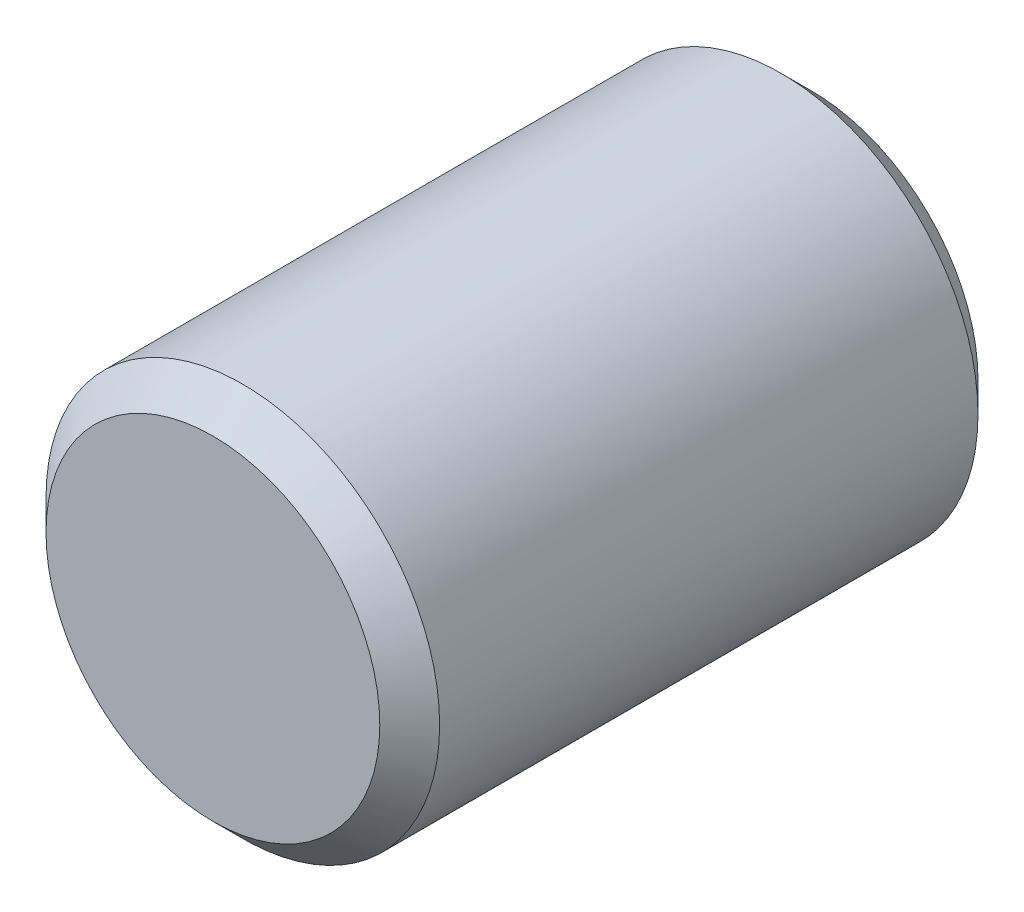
ISO-10303-21;
HEADER;
FILE_DESCRIPTION(('STEP AP214'),'2;1');
FILE_NAME('part.step','',(''),(''),'','','');
FILE_SCHEMA(('AUTOMOTIVE_DESIGN { 1 0 10303 214 1 1 1 1 }'));
ENDSEC;
DATA;
#1=APPLICATION_CONTEXT('core data for automotive mechanical design processes');
#2=APPLICATION_PROTOCOL_DEFINITION('international standard','automotive_design',2000,#1);
#3=PRODUCT_CONTEXT('',#1,'mechanical');
#4=PRODUCT('Part','Part','',(#3));
#5=PRODUCT_RELATED_PRODUCT_CATEGORY('part','',(#4));
#6=PRODUCT_DEFINITION_FORMATION('','',#4);
#7=PRODUCT_DEFINITION_CONTEXT('part definition',#1,'design');
#8=PRODUCT_DEFINITION('design','',#6,#7);
#9=PRODUCT_DEFINITION_SHAPE('','',#8);
#10=(LENGTH_UNIT() NAMED_UNIT(*) SI_UNIT(.MILLI.,.METRE.));
#11=(NAMED_UNIT(*) PLANE_ANGLE_UNIT() SI_UNIT($,.RADIAN.));
#12=(NAMED_UNIT(*) SI_UNIT($,.STERADIAN.) SOLID_ANGLE_UNIT());
#13=UNCERTAINTY_MEASURE_WITH_UNIT(LENGTH_MEASURE(1.E-05),#10,'distance_accuracy_value','');
#14=(GEOMETRIC_REPRESENTATION_CONTEXT(3) GLOBAL_UNCERTAINTY_ASSIGNED_CONTEXT((#13)) GLOBAL_UNIT_ASSIGNED_CONTEXT((#10,
#11,#12)) REPRESENTATION_CONTEXT('',''));
#15=CARTESIAN_POINT('',(0.,0.,0.));
#16=DIRECTION('',(0.,0.,1.));
#17=DIRECTION('',(1.,0.,0.));
#18=AXIS2_PLACEMENT_3D('',#15,#16,#17);
#19=CARTESIAN_POINT('',(0.,0.,20.));
#20=DIRECTION('',(0.,0.,-1.));
#21=DIRECTION('',(-1.,0.,0.));
#22=AXIS2_PLACEMENT_3D('',#19,#20,#21);
#23=CYLINDRICAL_SURFACE('',#22,6.58);
#24=CARTESIAN_POINT('',(0.,0.,1.00000000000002));
#25=DIRECTION('',(0.,0.,1.));
#26=DIRECTION('',(1.,0.,0.));
#27=AXIS2_PLACEMENT_3D('',#24,#25,#26);
#28=CIRCLE('',#27,6.58);
#29=CARTESIAN_POINT('',(-6.58,0.,1.00000000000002));
#30=VERTEX_POINT('',#29);
#31=EDGE_CURVE('E42',#30,#30,#28,.T.);
#32=CARTESIAN_POINT('',(0.,0.,19.));
#33=DIRECTION('',(0.,0.,1.));
#34=DIRECTION('',(1.,0.,0.));
#35=AXIS2_PLACEMENT_3D('',#32,#33,#34);
#36=CIRCLE('',#35,6.58);
#37=CARTESIAN_POINT('',(-6.58,0.,19.));
#38=VERTEX_POINT('',#37);
#39=EDGE_CURVE('E46',#38,#38,#36,.F.);
#40=CARTESIAN_POINT('',(-6.58,0.,1.00000000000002));
#41=CARTESIAN_POINT('',(-6.58,0.,1.18750000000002));
#42=CARTESIAN_POINT('',(-6.58,0.,1.37500000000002));
#43=CARTESIAN_POINT('',(-6.58,0.,1.75000000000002));
#44=CARTESIAN_POINT('',(-6.58,0.,1.93750000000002));
#45=CARTESIAN_POINT('',(-6.58,0.,2.31250000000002));
#46=CARTESIAN_POINT('',(-6.58,0.,2.50000000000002));
#47=CARTESIAN_POINT('',(-6.58,0.,2.87500000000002));
#48=CARTESIAN_POINT('',(-6.58,0.,3.06250000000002));
#49=CARTESIAN_POINT('',(-6.58,0.,3.43750000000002));
#50=CARTESIAN_POINT('',(-6.58,0.,3.62500000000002));
#51=CARTESIAN_POINT('',(-6.58,0.,4.00000000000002));
#52=CARTESIAN_POINT('',(-6.58,0.,4.18750000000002));
#53=CARTESIAN_POINT('',(-6.58,0.,4.56250000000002));
#54=CARTESIAN_POINT('',(-6.58,0.,4.75000000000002));
#55=CARTESIAN_POINT('',(-6.58,0.,5.12500000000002));
#56=CARTESIAN_POINT('',(-6.58,0.,5.31250000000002));
#57=CARTESIAN_POINT('',(-6.58,0.,5.68750000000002));
#58=CARTESIAN_POINT('',(-6.58,0.,5.87500000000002));
#59=CARTESIAN_POINT('',(-6.58,0.,6.25000000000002));
#60=CARTESIAN_POINT('',(-6.58,0.,6.43750000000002));
#61=CARTESIAN_POINT('',(-6.58,0.,6.81250000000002));
#62=CARTESIAN_POINT('',(-6.58,0.,7.00000000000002));
#63=CARTESIAN_POINT('',(-6.58,0.,7.37500000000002));
#64=CARTESIAN_POINT('',(-6.58,0.,7.56250000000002));
#65=CARTESIAN_POINT('',(-6.58,0.,7.93750000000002));
#66=CARTESIAN_POINT('',(-6.58,0.,8.12500000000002));
#67=CARTESIAN_POINT('',(-6.58,0.,8.50000000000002));
#68=CARTESIAN_POINT('',(-6.58,0.,8.68750000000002));
#69=CARTESIAN_POINT('',(-6.58,0.,9.06250000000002));
#70=CARTESIAN_POINT('',(-6.58,0.,9.25000000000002));
#71=CARTESIAN_POINT('',(-6.58,0.,9.62500000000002));
#72=CARTESIAN_POINT('',(-6.58,0.,9.81250000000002));
#73=CARTESIAN_POINT('',(-6.58,0.,10.1875));
#74=CARTESIAN_POINT('',(-6.58,0.,10.375));
#75=CARTESIAN_POINT('',(-6.58,0.,10.75));
#76=CARTESIAN_POINT('',(-6.58,0.,10.9375));
#77=CARTESIAN_POINT('',(-6.58,0.,11.3125));
#78=CARTESIAN_POINT('',(-6.58,0.,11.5));
#79=CARTESIAN_POINT('',(-6.58,0.,11.875));
#80=CARTESIAN_POINT('',(-6.58,0.,12.0625));
#81=CARTESIAN_POINT('',(-6.58,0.,12.4375));
#82=CARTESIAN_POINT('',(-6.58,0.,12.625));
#83=CARTESIAN_POINT('',(-6.58,0.,13.));
#84=CARTESIAN_POINT('',(-6.58,0.,13.1875));
#85=CARTESIAN_POINT('',(-6.58,0.,13.5625));
#86=CARTESIAN_POINT('',(-6.58,0.,13.75));
#87=CARTESIAN_POINT('',(-6.58,0.,14.125));
#88=CARTESIAN_POINT('',(-6.58,0.,14.3125));
#89=CARTESIAN_POINT('',(-6.58,0.,14.6875));
#90=CARTESIAN_POINT('',(-6.58,0.,14.875));
#91=CARTESIAN_POINT('',(-6.58,0.,15.25));
#92=CARTESIAN_POINT('',(-6.58,0.,15.4375));
#93=CARTESIAN_POINT('',(-6.58,0.,15.8125));
#94=CARTESIAN_POINT('',(-6.58,0.,16.));
#95=CARTESIAN_POINT('',(-6.58,0.,16.375));
#96=CARTESIAN_POINT('',(-6.58,0.,16.5625));
#97=CARTESIAN_POINT('',(-6.58,0.,16.9375));
#98=CARTESIAN_POINT('',(-6.58,0.,17.125));
#99=CARTESIAN_POINT('',(-6.58,0.,17.5));
#100=CARTESIAN_POINT('',(-6.58,0.,17.6875));
#101=CARTESIAN_POINT('',(-6.58,0.,18.0625));
#102=CARTESIAN_POINT('',(-6.58,0.,18.25));
#103=CARTESIAN_POINT('',(-6.58,0.,18.625));
#104=CARTESIAN_POINT('',(-6.58,0.,18.8125));
#105=CARTESIAN_POINT('',(-6.58,0.,19.));
#106=B_SPLINE_CURVE_WITH_KNOTS('',3,(#40,#41,#42,#43,#44,#45,#46,#47,#48,#49,#50,#51,#52,#53,
#54,#55,#56,#57,#58,#59,#60,#61,#62,#63,#64,#65,#66,#67,#68,#69,#70,#71,#72,#73,#74,#75,#76,#77,
#78,#79,#80,#81,#82,#83,#84,#85,#86,#87,#88,#89,#90,#91,#92,#93,#94,#95,#96,#97,#98,#99,#100,
#101,#102,#103,#104,#105),.UNSPECIFIED.,.F.,.F.,(4,2,2,2,2,2,2,2,2,2,2,2,2,2,2,2,2,2,2,2,2,2,2,
2,2,2,2,2,2,2,2,2,4),(0.,0.5625,1.125,1.6875,2.25,2.8125,3.375,3.9375,4.5,5.0625,5.625,6.1875,
6.75,7.3125,7.875,8.4375,9.,9.5625,10.125,10.6875,11.25,11.8125,12.375,12.9375,13.5,14.0625,
14.625,15.1875,15.75,16.3125,16.875,17.4375,18.),.UNSPECIFIED.);
#107=EDGE_CURVE('BSEAM31',#30,#38,#106,.T.);
#108=ORIENTED_EDGE('',*,*,#31,.T.);
#109=ORIENTED_EDGE('',*,*,#39,.T.);
#110=ORIENTED_EDGE('',*,*,#107,.T.);
#111=ORIENTED_EDGE('',*,*,#107,.F.);
#112=EDGE_LOOP('',(#108,#110,#109,#111));
#113=FACE_BOUND('',#112,.T.);
#114=ADVANCED_FACE('F31',(#113),#23,.T.);
#115=CARTESIAN_POINT('',(0.,0.,20.));
#116=DIRECTION('',(0.,0.,1.));
#117=DIRECTION('',(1.,0.,0.));
#118=AXIS2_PLACEMENT_3D('',#115,#116,#117);
#119=PLANE('',#118);
#120=CARTESIAN_POINT('',(0.,0.,20.));
#121=DIRECTION('',(0.,0.,1.));
#122=DIRECTION('',(1.,0.,0.));
#123=AXIS2_PLACEMENT_3D('',#120,#121,#122);
#124=CIRCLE('',#123,5.58000000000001);
#125=CARTESIAN_POINT('',(5.58000000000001,0.,20.));
#126=VERTEX_POINT('',#125);
#127=EDGE_CURVE('E10',#126,#126,#124,.T.);
#128=ORIENTED_EDGE('',*,*,#127,.T.);
#129=EDGE_LOOP('',(#128));
#130=FACE_BOUND('',#129,.T.);
#131=ADVANCED_FACE('F62',(#130),#119,.T.);
#132=CARTESIAN_POINT('',(0.,0.,0.));
#133=DIRECTION('',(0.,0.,1.));
#134=DIRECTION('',(1.,0.,0.));
#135=AXIS2_PLACEMENT_3D('',#132,#133,#134);
#136=PLANE('',#135);
#137=CARTESIAN_POINT('',(0.,0.,0.));
#138=DIRECTION('',(0.,0.,1.));
#139=DIRECTION('',(1.,0.,0.));
#140=AXIS2_PLACEMENT_3D('',#137,#138,#139);
#141=CIRCLE('',#140,5.57999999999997);
#142=CARTESIAN_POINT('',(5.57999999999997,0.,0.));
#143=VERTEX_POINT('',#142);
#144=EDGE_CURVE('E38',#143,#143,#141,.F.);
#145=ORIENTED_EDGE('',*,*,#144,.T.);
#146=EDGE_LOOP('',(#145));
#147=FACE_BOUND('',#146,.T.);
#148=ADVANCED_FACE('F59',(#147),#136,.F.);
#149=CARTESIAN_POINT('',(0.,0.,1.00000000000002));
#150=DIRECTION('',(0.,0.,1.));
#151=DIRECTION('',(1.,0.,0.));
#152=AXIS2_PLACEMENT_3D('',#149,#150,#151);
#153=CONICAL_SURFACE('',#152,6.58,0.78539816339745);
#154=ORIENTED_EDGE('',*,*,#144,.F.);
#155=EDGE_LOOP('',(#154));
#156=FACE_BOUND('',#155,.T.);
#157=ORIENTED_EDGE('',*,*,#31,.F.);
#158=EDGE_LOOP('',(#157));
#159=FACE_BOUND('',#158,.T.);
#160=ADVANCED_FACE('F55',(#156,#159),#153,.T.);
#161=CARTESIAN_POINT('',(0.,0.,20.));
#162=DIRECTION('',(0.,0.,-1.));
#163=DIRECTION('',(-1.,0.,0.));
#164=AXIS2_PLACEMENT_3D('',#161,#162,#163);
#165=CONICAL_SURFACE('',#164,5.58000000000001,0.785398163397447);
#166=ORIENTED_EDGE('',*,*,#39,.F.);
#167=EDGE_LOOP('',(#166));
#168=FACE_BOUND('',#167,.T.);
#169=ORIENTED_EDGE('',*,*,#127,.F.);
#170=EDGE_LOOP('',(#169));
#171=FACE_BOUND('',#170,.T.);
#172=ADVANCED_FACE('F33',(#168,#171),#165,.T.);
#173=CLOSED_SHELL('',(#114,#131,#148,#160,#172));
#174=MANIFOLD_SOLID_BREP('B2',#173);
#175=ADVANCED_BREP_SHAPE_REPRESENTATION('',(#18,#174),#14);
#176=SHAPE_DEFINITION_REPRESENTATION(#9,#175);
ENDSEC;
END-ISO-10303-21;
